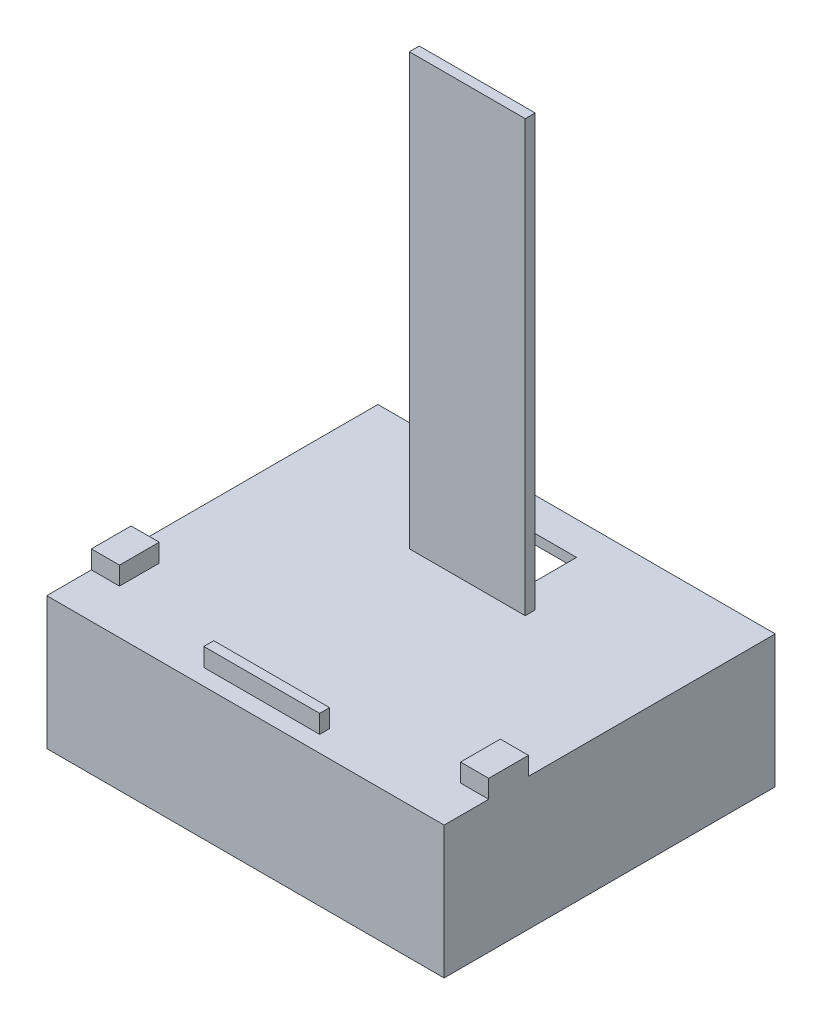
from build123d import *

# Parameters (mm, degrees)
SKETCH1_W           = 120
SKETCH1_H           = 100
BOSS_EXTRUDE1_DEPTH = 40
SHELL1_T            = -3
SKETCH3_W           = 35
SKETCH3_H           = 3
BOSS_EXTRUDE4_DEPTH = 130
SKETCH2_W           = 35
SKETCH2_H           = 3
SKETCH2_W_2         = 8.5
SKETCH2_H_2         = 12
BOSS_EXTRUDE2_DEPTH = 5.5
SKETCH3_3_W         = 20
SKETCH3_3_H         = 20
CUT_EXTRUDE1_DEPTH  = 3


with BuildPart() as part:
    # Sketch1 → Boss-Extrude1 (new body)
    with BuildSketch(Plane(origin=(0, 0, 0), x_dir=(1, 0, 0), z_dir=(0, 1, 0))):
        Rectangle(SKETCH1_W, SKETCH1_H)
    extrude(amount=BOSS_EXTRUDE1_DEPTH)

    # Shell1
    shell1_openings = [part.faces().sort_by_distance(p)[0] for p in [
        (0, 20, -50),
    ]]
    offset(amount=SHELL1_T, openings=shell1_openings, kind=Kind.INTERSECTION)

    # Sketch3 → Boss-Extrude4 (add)
    with BuildSketch(Plane(origin=(0, 40, 0), x_dir=(1, 0, 0), z_dir=(0, 1, 0))):
        with Locations((0, 18.5)):
            Rectangle(SKETCH3_W, SKETCH3_H)
    extrude(amount=BOSS_EXTRUDE4_DEPTH)

    # Sketch2 → Boss-Extrude2 (add)
    with BuildSketch(Plane(origin=(0, 40, 0), x_dir=(1, 0, 0), z_dir=(0, 1, 0))):
        with Locations((0, -43.573340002)):
            Rectangle(SKETCH2_W, SKETCH2_H)
        with Locations((55.75, -30.533136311)):
            Rectangle(SKETCH2_W_2, SKETCH2_H_2)
        with Locations((-55.75, -30.533136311)):
            Rectangle(SKETCH2_W_2, SKETCH2_H_2)
    extrude(amount=BOSS_EXTRUDE2_DEPTH)

    # Sketch3_3 → Cut-Extrude1 (cut)
    with BuildSketch(Plane(origin=(0, 40, 0), x_dir=(1, 0, 0), z_dir=(0, 1, 0))):
        with Locations((0, 30)):
            Rectangle(SKETCH3_3_W, SKETCH3_3_H)
    extrude(amount=-CUT_EXTRUDE1_DEPTH, mode=Mode.SUBTRACT)


solid = part.part
